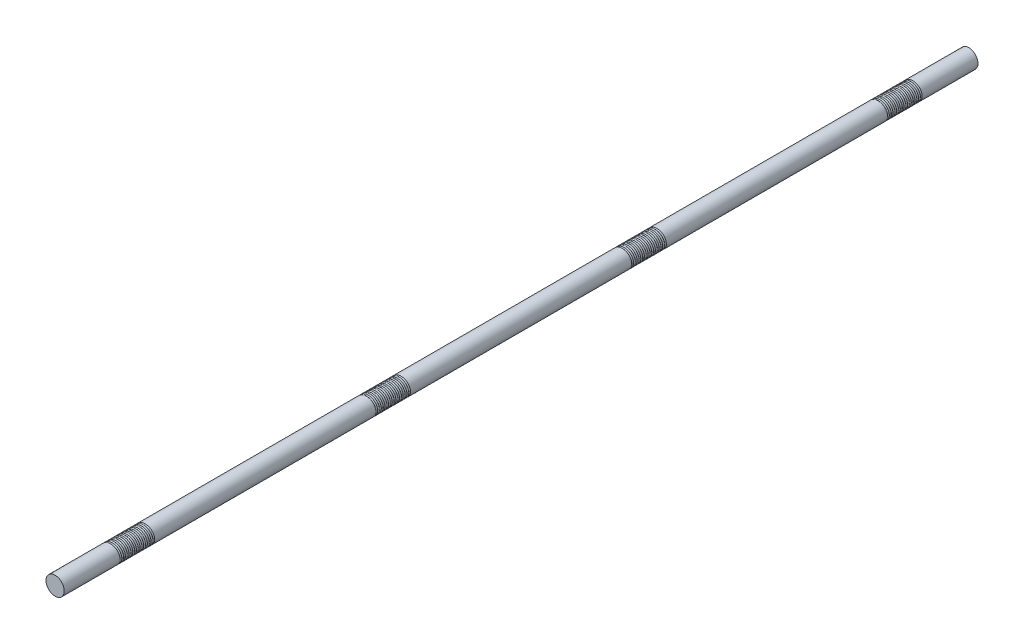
from build123d import *

# Parameters (mm, degrees)
SKETCH1_R              = 25
BOSS_EXTRUDE1_DEPTH    = 2500
CUT_SWEEP1_PITCH       = 10
CUT_SWEEP1_HEIGHT      = 100
CUT_SWEEP1_RADIUS      = 27.116666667
CUT_SWEEP1_START_ANGLE = -180
SKETCH3_R              = 3.175
LPATTERN1_COUNT        = 4
LPATTERN1_PITCH        = 700


with BuildPart() as part:
    # Sketch1 → Boss-Extrude1 (new body)
    with BuildSketch(Plane.XY):
        Circle(SKETCH1_R)
    extrude(amount=BOSS_EXTRUDE1_DEPTH)

    # Cut-Sweep1: sweep along a helix
    with BuildLine() as cut_sweep1_path:
        add(Helix(CUT_SWEEP1_PITCH, CUT_SWEEP1_HEIGHT, CUT_SWEEP1_RADIUS, center=(0, 0, 150), direction=(0, 0, 1), mode=Mode.PRIVATE).rotate(Axis((0, 0, 150), (0, 0, 1)), CUT_SWEEP1_START_ANGLE))
    # Sketch3 → Cut-Sweep1 (sweep, cut)
    with BuildSketch(Plane(origin=(0, 0, 0), x_dir=(1, 0, 0), z_dir=(0, 1, 0))):
        with Locations((-27.116666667, -150)):
            Circle(SKETCH3_R)
    cut_sweep1 = sweep(path=cut_sweep1_path.line, is_frenet=True, mode=Mode.SUBTRACT)

    # LPattern1: Cut-Sweep1 ×4
    with Locations(*[(0, 0, i * LPATTERN1_PITCH) for i in range(1, LPATTERN1_COUNT)]):
        add(cut_sweep1, mode=Mode.SUBTRACT)


solid = part.part
